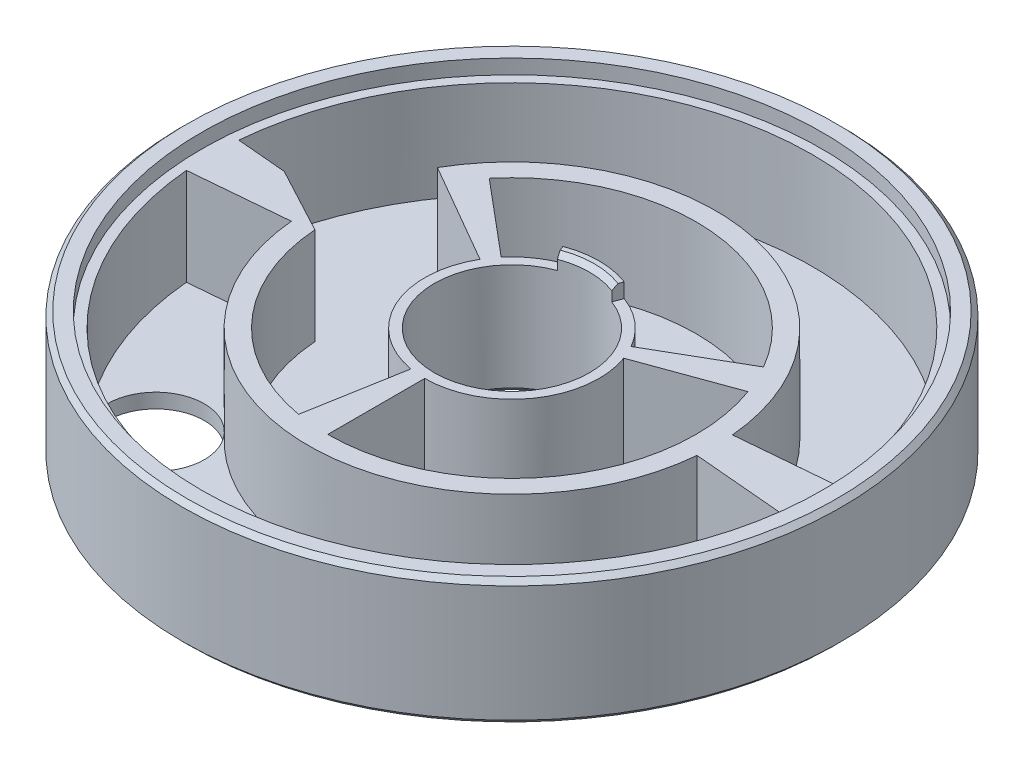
ISO-10303-21;
HEADER;
FILE_DESCRIPTION(('STEP AP214'),'2;1');
FILE_NAME('part.step','',(''),(''),'','','');
FILE_SCHEMA(('AUTOMOTIVE_DESIGN { 1 0 10303 214 1 1 1 1 }'));
ENDSEC;
DATA;
#1=APPLICATION_CONTEXT('core data for automotive mechanical design processes');
#2=APPLICATION_PROTOCOL_DEFINITION('international standard','automotive_design',2000,#1);
#3=PRODUCT_CONTEXT('',#1,'mechanical');
#4=PRODUCT('Part','Part','',(#3));
#5=PRODUCT_RELATED_PRODUCT_CATEGORY('part','',(#4));
#6=PRODUCT_DEFINITION_FORMATION('','',#4);
#7=PRODUCT_DEFINITION_CONTEXT('part definition',#1,'design');
#8=PRODUCT_DEFINITION('design','',#6,#7);
#9=PRODUCT_DEFINITION_SHAPE('','',#8);
#10=(LENGTH_UNIT() NAMED_UNIT(*) SI_UNIT(.MILLI.,.METRE.));
#11=(NAMED_UNIT(*) PLANE_ANGLE_UNIT() SI_UNIT($,.RADIAN.));
#12=(NAMED_UNIT(*) SI_UNIT($,.STERADIAN.) SOLID_ANGLE_UNIT());
#13=UNCERTAINTY_MEASURE_WITH_UNIT(LENGTH_MEASURE(1.E-05),#10,'distance_accuracy_value','');
#14=(GEOMETRIC_REPRESENTATION_CONTEXT(3) GLOBAL_UNCERTAINTY_ASSIGNED_CONTEXT((#13)) GLOBAL_UNIT_ASSIGNED_CONTEXT((#10,
#11,#12)) REPRESENTATION_CONTEXT('',''));
#15=CARTESIAN_POINT('',(0.,0.,0.));
#16=DIRECTION('',(0.,0.,1.));
#17=DIRECTION('',(1.,0.,0.));
#18=AXIS2_PLACEMENT_3D('',#15,#16,#17);
#19=CARTESIAN_POINT('',(-30.8820356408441,-11.5,2.70182802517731));
#20=DIRECTION('',(0.,-1.,0.));
#21=DIRECTION('',(0.,0.,-1.));
#22=AXIS2_PLACEMENT_3D('',#19,#20,#21);
#23=PLANE('',#22);
#24=CARTESIAN_POINT('',(-19.1097515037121,-11.5,17.6300141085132));
#25=DIRECTION('',(0.,1.,0.));
#26=DIRECTION('',(0.,0.,1.));
#27=AXIS2_PLACEMENT_3D('',#24,#25,#26);
#28=CIRCLE('',#27,5.);
#29=CARTESIAN_POINT('',(-15.4347992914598,-11.5,14.2396267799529));
#30=VERTEX_POINT('',#29);
#31=CARTESIAN_POINT('',(-22.7847037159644,-11.5,21.0204014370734));
#32=VERTEX_POINT('',#31);
#33=EDGE_CURVE('E47',#30,#32,#28,.T.);
#34=ORIENTED_EDGE('',*,*,#33,.F.);
#35=CARTESIAN_POINT('',(0.,-11.5,0.));
#36=DIRECTION('',(0.,1.,0.));
#37=DIRECTION('',(0.,0.,1.));
#38=AXIS2_PLACEMENT_3D('',#35,#36,#37);
#39=CIRCLE('',#38,21.);
#40=CARTESIAN_POINT('',(-20.9200886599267,-11.5,1.83027059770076));
#41=VERTEX_POINT('',#40);
#42=EDGE_CURVE('E231',#41,#30,#39,.T.);
#43=ORIENTED_EDGE('',*,*,#42,.F.);
#44=DIRECTION('',(0.996194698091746,0.,-0.0871557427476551));
#45=VECTOR('',#44,1.);
#46=CARTESIAN_POINT('',(-30.8820356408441,-11.5,2.70182802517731));
#47=LINE('',#46,#45);
#48=CARTESIAN_POINT('',(-30.8820356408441,-11.5,2.70182802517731));
#49=VERTEX_POINT('',#48);
#50=EDGE_CURVE('E476',#49,#41,#47,.T.);
#51=ORIENTED_EDGE('',*,*,#50,.F.);
#52=CARTESIAN_POINT('',(0.,-11.5,0.));
#53=DIRECTION('',(0.,1.,0.));
#54=DIRECTION('',(0.,0.,1.));
#55=AXIS2_PLACEMENT_3D('',#52,#53,#54);
#56=CIRCLE('',#55,31.);
#57=EDGE_CURVE('E234',#49,#32,#56,.T.);
#58=ORIENTED_EDGE('',*,*,#57,.T.);
#59=EDGE_LOOP('',(#34,#43,#51,#58));
#60=FACE_BOUND('',#59,.T.);
#61=ADVANCED_FACE('F33',(#60),#23,.F.);
#62=EDGE_CURVE('E221',#32,#30,#28,.T.);
#63=ORIENTED_EDGE('',*,*,#62,.F.);
#64=CARTESIAN_POINT('',(30.8820356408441,-11.5,2.70182802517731));
#65=VERTEX_POINT('',#64);
#66=EDGE_CURVE('E249',#32,#65,#56,.T.);
#67=ORIENTED_EDGE('',*,*,#66,.T.);
#68=DIRECTION('',(-0.996194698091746,0.,-0.087155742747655));
#69=VECTOR('',#68,1.);
#70=CARTESIAN_POINT('',(30.8820356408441,-11.5,2.70182802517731));
#71=LINE('',#70,#69);
#72=CARTESIAN_POINT('',(20.9200886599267,-11.5,1.83027059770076));
#73=VERTEX_POINT('',#72);
#74=EDGE_CURVE('E240',#65,#73,#71,.T.);
#75=ORIENTED_EDGE('',*,*,#74,.T.);
#76=EDGE_CURVE('E237',#30,#73,#39,.T.);
#77=ORIENTED_EDGE('',*,*,#76,.F.);
#78=EDGE_LOOP('',(#63,#67,#75,#77));
#79=FACE_BOUND('',#78,.T.);
#80=ADVANCED_FACE('F238',(#79),#23,.F.);
#81=CARTESIAN_POINT('',(17.8541597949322,-11.5,-6.49838272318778));
#82=DIRECTION('',(0.,1.,0.));
#83=DIRECTION('',(0.,0.,1.));
#84=AXIS2_PLACEMENT_3D('',#81,#82,#83);
#85=PLANE('',#84);
#86=CARTESIAN_POINT('',(13.9709190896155,-11.5,0.901897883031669));
#87=DIRECTION('',(0.,1.,0.));
#88=DIRECTION('',(0.,0.,1.));
#89=AXIS2_PLACEMENT_3D('',#86,#87,#88);
#90=CIRCLE('',#89,5.);
#91=CARTESIAN_POINT('',(18.9605330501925,-11.5,1.22400426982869));
#92=VERTEX_POINT('',#91);
#93=CARTESIAN_POINT('',(8.98130512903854,-11.5,0.579791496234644));
#94=VERTEX_POINT('',#93);
#95=EDGE_CURVE('E54',#92,#94,#90,.T.);
#96=ORIENTED_EDGE('',*,*,#95,.F.);
#97=CARTESIAN_POINT('',(0.,-11.5,0.));
#98=DIRECTION('',(0.,-1.,0.));
#99=DIRECTION('',(0.,0.,-1.));
#100=AXIS2_PLACEMENT_3D('',#97,#98,#99);
#101=CIRCLE('',#100,19.);
#102=CARTESIAN_POINT('',(17.8541597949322,-11.5,-6.49838272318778));
#103=VERTEX_POINT('',#102);
#104=EDGE_CURVE('E317',#103,#92,#101,.T.);
#105=ORIENTED_EDGE('',*,*,#104,.F.);
#106=DIRECTION('',(-0.939692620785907,0.,0.342020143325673));
#107=VECTOR('',#106,1.);
#108=CARTESIAN_POINT('',(17.8541597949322,-11.5,-6.49838272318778));
#109=LINE('',#108,#107);
#110=CARTESIAN_POINT('',(8.45723358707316,-11.5,-3.07818128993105));
#111=VERTEX_POINT('',#110);
#112=EDGE_CURVE('E306',#103,#111,#109,.T.);
#113=ORIENTED_EDGE('',*,*,#112,.T.);
#114=CARTESIAN_POINT('',(0.,-11.5,0.));
#115=DIRECTION('',(0.,-1.,0.));
#116=DIRECTION('',(0.,0.,-1.));
#117=AXIS2_PLACEMENT_3D('',#114,#115,#116);
#118=CIRCLE('',#117,9.);
#119=EDGE_CURVE('E313',#111,#94,#118,.T.);
#120=ORIENTED_EDGE('',*,*,#119,.T.);
#121=EDGE_LOOP('',(#96,#105,#113,#120));
#122=FACE_BOUND('',#121,.T.);
#123=ADVANCED_FACE('F506',(#122),#85,.T.);
#124=CARTESIAN_POINT('',(-3.29931537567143,-11.5,18.711347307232));
#125=DIRECTION('',(0.,1.,0.));
#126=DIRECTION('',(-0.866025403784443,0.,-0.499999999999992));
#127=AXIS2_PLACEMENT_3D('',#124,#125,#126);
#128=PLANE('',#127);
#129=CARTESIAN_POINT('',(24.9533913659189,-11.5,-7.30262003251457));
#130=DIRECTION('',(0.,1.,0.));
#131=DIRECTION('',(0.,0.,1.));
#132=AXIS2_PLACEMENT_3D('',#129,#130,#131);
#133=CIRCLE('',#132,5.);
#134=CARTESIAN_POINT('',(29.7521204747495,-11.5,-8.70697003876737));
#135=VERTEX_POINT('',#134);
#136=CARTESIAN_POINT('',(20.1546622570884,-11.5,-5.89827002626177));
#137=VERTEX_POINT('',#136);
#138=EDGE_CURVE('E907',#135,#137,#133,.T.);
#139=ORIENTED_EDGE('',*,*,#138,.F.);
#140=CARTESIAN_POINT('',(0.,-11.5,0.));
#141=DIRECTION('',(0.,1.,0.));
#142=DIRECTION('',(0.,0.,-1.));
#143=AXIS2_PLACEMENT_3D('',#140,#141,#142);
#144=CIRCLE('',#143,31.);
#145=CARTESIAN_POINT('',(-30.8820356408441,-11.5,-2.70182802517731));
#146=VERTEX_POINT('',#145);
#147=EDGE_CURVE('E446',#135,#146,#144,.T.);
#148=ORIENTED_EDGE('',*,*,#147,.T.);
#149=DIRECTION('',(0.996194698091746,0.,0.087155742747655));
#150=VECTOR('',#149,1.);
#151=CARTESIAN_POINT('',(-30.8820356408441,-11.5,-2.70182802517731));
#152=LINE('',#151,#150);
#153=CARTESIAN_POINT('',(-25.7458783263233,-11.5,-2.25247248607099));
#154=VERTEX_POINT('',#153);
#155=EDGE_CURVE('E435',#146,#154,#152,.T.);
#156=ORIENTED_EDGE('',*,*,#155,.T.);
#157=DIRECTION('',(-0.882044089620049,0.,-0.471166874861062));
#158=VECTOR('',#157,1.);
#159=CARTESIAN_POINT('',(-17.837276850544,-11.5,1.97211343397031));
#160=LINE('',#159,#158);
#161=CARTESIAN_POINT('',(-18.9499829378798,-11.5,1.37773243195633));
#162=VERTEX_POINT('',#161);
#163=EDGE_CURVE('E444',#162,#154,#160,.T.);
#164=ORIENTED_EDGE('',*,*,#163,.F.);
#165=CARTESIAN_POINT('',(0.,-11.5,0.));
#166=DIRECTION('',(0.,-1.,0.));
#167=DIRECTION('',(0.866025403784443,0.,0.499999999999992));
#168=AXIS2_PLACEMENT_3D('',#165,#166,#167);
#169=CIRCLE('',#168,19.);
#170=CARTESIAN_POINT('',(-3.29931537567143,-11.5,18.711347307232));
#171=VERTEX_POINT('',#170);
#172=EDGE_CURVE('E269',#171,#162,#169,.T.);
#173=ORIENTED_EDGE('',*,*,#172,.F.);
#174=DIRECTION('',(0.173648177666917,0.,-0.98480775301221));
#175=VECTOR('',#174,1.);
#176=CARTESIAN_POINT('',(-3.29931537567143,-11.5,18.711347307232));
#177=LINE('',#176,#175);
#178=CARTESIAN_POINT('',(-1.56283359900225,-11.5,8.86326977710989));
#179=VERTEX_POINT('',#178);
#180=EDGE_CURVE('E261',#171,#179,#177,.T.);
#181=ORIENTED_EDGE('',*,*,#180,.T.);
#182=CARTESIAN_POINT('',(0.,-11.5,0.));
#183=DIRECTION('',(0.,-1.,0.));
#184=DIRECTION('',(0.866025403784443,0.,0.499999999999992));
#185=AXIS2_PLACEMENT_3D('',#182,#183,#184);
#186=CIRCLE('',#185,9.);
#187=CARTESIAN_POINT('',(-7.79422863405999,-11.5,-4.49999999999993));
#188=VERTEX_POINT('',#187);
#189=EDGE_CURVE('E267',#179,#188,#186,.T.);
#190=ORIENTED_EDGE('',*,*,#189,.T.);
#191=DIRECTION('',(0.866025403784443,0.,0.499999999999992));
#192=VECTOR('',#191,1.);
#193=CARTESIAN_POINT('',(-16.4544826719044,-11.5,-9.49999999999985));
#194=LINE('',#193,#192);
#195=CARTESIAN_POINT('',(-18.1865334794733,-11.5,-10.5));
#196=VERTEX_POINT('',#195);
#197=EDGE_CURVE('E254',#196,#188,#194,.T.);
#198=ORIENTED_EDGE('',*,*,#197,.F.);
#199=CARTESIAN_POINT('',(0.,-11.5,0.));
#200=DIRECTION('',(0.,1.,0.));
#201=DIRECTION('',(0.,0.,-1.));
#202=AXIS2_PLACEMENT_3D('',#199,#200,#201);
#203=CIRCLE('',#202,21.);
#204=EDGE_CURVE('E462',#137,#196,#203,.T.);
#205=ORIENTED_EDGE('',*,*,#204,.F.);
#206=EDGE_LOOP('',(#139,#148,#156,#164,#173,#181,#190,#198,#205));
#207=FACE_BOUND('',#206,.T.);
#208=ADVANCED_FACE('F442',(#207),#128,.T.);
#209=CARTESIAN_POINT('',(0.,-1.5,0.));
#210=DIRECTION('',(0.,1.,0.));
#211=DIRECTION('',(0.,0.,1.));
#212=AXIS2_PLACEMENT_3D('',#209,#210,#211);
#213=PLANE('',#212);
#214=DIRECTION('',(0.882044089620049,0.,0.471166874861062));
#215=VECTOR('',#214,1.);
#216=CARTESIAN_POINT('',(-4.77943431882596,-1.5,8.94730087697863));
#217=LINE('',#216,#215);
#218=CARTESIAN_POINT('',(-25.7458783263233,-1.5,-2.252472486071));
#219=VERTEX_POINT('',#218);
#220=CARTESIAN_POINT('',(-18.9499829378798,-1.5,1.37773243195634));
#221=VERTEX_POINT('',#220);
#222=EDGE_CURVE('E911',#219,#221,#217,.T.);
#223=ORIENTED_EDGE('',*,*,#222,.F.);
#224=DIRECTION('',(0.996194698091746,0.,0.087155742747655));
#225=VECTOR('',#224,1.);
#226=CARTESIAN_POINT('',(0.,-1.5,0.));
#227=LINE('',#226,#225);
#228=CARTESIAN_POINT('',(-30.8820356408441,-1.5,-2.70182802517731));
#229=VERTEX_POINT('',#228);
#230=EDGE_CURVE('E420',#229,#219,#227,.T.);
#231=ORIENTED_EDGE('',*,*,#230,.F.);
#232=CARTESIAN_POINT('',(0.,-1.5,0.));
#233=DIRECTION('',(0.,1.,0.));
#234=DIRECTION('',(0.,0.,1.));
#235=AXIS2_PLACEMENT_3D('',#232,#233,#234);
#236=CIRCLE('',#235,31.);
#237=CARTESIAN_POINT('',(30.8820356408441,-1.5,-2.70182802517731));
#238=VERTEX_POINT('',#237);
#239=EDGE_CURVE('E425',#238,#229,#236,.T.);
#240=ORIENTED_EDGE('',*,*,#239,.F.);
#241=DIRECTION('',(-0.996194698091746,0.,0.087155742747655));
#242=VECTOR('',#241,1.);
#243=CARTESIAN_POINT('',(0.,-1.5,0.));
#244=LINE('',#243,#242);
#245=CARTESIAN_POINT('',(20.9200886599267,-1.5,-1.83027059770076));
#246=VERTEX_POINT('',#245);
#247=EDGE_CURVE('E428',#238,#246,#244,.T.);
#248=ORIENTED_EDGE('',*,*,#247,.T.);
#249=CARTESIAN_POINT('',(0.,-1.5,0.));
#250=DIRECTION('',(0.,1.,0.));
#251=DIRECTION('',(0.,0.,1.));
#252=AXIS2_PLACEMENT_3D('',#249,#250,#251);
#253=CIRCLE('',#252,21.);
#254=CARTESIAN_POINT('',(-18.1865334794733,-1.5,-10.5));
#255=VERTEX_POINT('',#254);
#256=EDGE_CURVE('E423',#255,#246,#253,.F.);
#257=ORIENTED_EDGE('',*,*,#256,.F.);
#258=DIRECTION('',(0.866025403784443,0.,0.499999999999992));
#259=VECTOR('',#258,1.);
#260=CARTESIAN_POINT('',(0.,-1.5,0.));
#261=LINE('',#260,#259);
#262=CARTESIAN_POINT('',(-7.79422863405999,-1.5,-4.49999999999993));
#263=VERTEX_POINT('',#262);
#264=EDGE_CURVE('E399',#255,#263,#261,.T.);
#265=ORIENTED_EDGE('',*,*,#264,.T.);
#266=CARTESIAN_POINT('',(0.,-1.5,0.));
#267=DIRECTION('',(0.,1.,0.));
#268=DIRECTION('',(0.,0.,1.));
#269=AXIS2_PLACEMENT_3D('',#266,#267,#268);
#270=CIRCLE('',#269,9.);
#271=CARTESIAN_POINT('',(-1.56283359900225,-1.5,8.8632697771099));
#272=VERTEX_POINT('',#271);
#273=EDGE_CURVE('E402',#263,#272,#270,.T.);
#274=ORIENTED_EDGE('',*,*,#273,.T.);
#275=DIRECTION('',(0.173648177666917,0.,-0.984807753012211));
#276=VECTOR('',#275,1.);
#277=CARTESIAN_POINT('',(0.,-1.5,0.));
#278=LINE('',#277,#276);
#279=CARTESIAN_POINT('',(-3.29931537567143,-1.5,18.711347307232));
#280=VERTEX_POINT('',#279);
#281=EDGE_CURVE('E408',#280,#272,#278,.T.);
#282=ORIENTED_EDGE('',*,*,#281,.F.);
#283=CARTESIAN_POINT('',(0.,-1.5,0.));
#284=DIRECTION('',(0.,1.,0.));
#285=DIRECTION('',(0.,0.,1.));
#286=AXIS2_PLACEMENT_3D('',#283,#284,#285);
#287=CIRCLE('',#286,19.);
#288=EDGE_CURVE('E405',#280,#221,#287,.F.);
#289=ORIENTED_EDGE('',*,*,#288,.T.);
#290=EDGE_LOOP('',(#223,#231,#240,#248,#257,#265,#274,#282,#289));
#291=FACE_BOUND('',#290,.T.);
#292=CARTESIAN_POINT('',(0.,-1.5,0.));
#293=DIRECTION('',(0.,1.,0.));
#294=DIRECTION('',(0.,0.,1.));
#295=AXIS2_PLACEMENT_3D('',#292,#293,#294);
#296=CIRCLE('',#295,31.);
#297=CARTESIAN_POINT('',(-30.8820356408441,-1.5,2.70182802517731));
#298=VERTEX_POINT('',#297);
#299=CARTESIAN_POINT('',(30.8820356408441,-1.5,2.70182802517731));
#300=VERTEX_POINT('',#299);
#301=EDGE_CURVE('E414',#298,#300,#296,.T.);
#302=ORIENTED_EDGE('',*,*,#301,.F.);
#303=DIRECTION('',(0.996194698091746,0.,-0.087155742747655));
#304=VECTOR('',#303,1.);
#305=CARTESIAN_POINT('',(0.,-1.5,0.));
#306=LINE('',#305,#304);
#307=CARTESIAN_POINT('',(-20.9200886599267,-1.5,1.83027059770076));
#308=VERTEX_POINT('',#307);
#309=EDGE_CURVE('E417',#298,#308,#306,.T.);
#310=ORIENTED_EDGE('',*,*,#309,.T.);
#311=CARTESIAN_POINT('',(0.,-1.5,0.));
#312=DIRECTION('',(0.,1.,0.));
#313=DIRECTION('',(0.,0.,1.));
#314=AXIS2_PLACEMENT_3D('',#311,#312,#313);
#315=CIRCLE('',#314,21.);
#316=CARTESIAN_POINT('',(20.9200886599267,-1.5,1.83027059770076));
#317=VERTEX_POINT('',#316);
#318=EDGE_CURVE('E412',#317,#308,#315,.F.);
#319=ORIENTED_EDGE('',*,*,#318,.F.);
#320=DIRECTION('',(-0.996194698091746,0.,-0.087155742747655));
#321=VECTOR('',#320,1.);
#322=CARTESIAN_POINT('',(0.,-1.5,0.));
#323=LINE('',#322,#321);
#324=EDGE_CURVE('E410',#300,#317,#323,.T.);
#325=ORIENTED_EDGE('',*,*,#324,.F.);
#326=EDGE_LOOP('',(#302,#310,#319,#325));
#327=FACE_BOUND('',#326,.T.);
#328=CARTESIAN_POINT('',(0.,-1.5,0.));
#329=DIRECTION('',(0.,1.,0.));
#330=DIRECTION('',(0.,0.,1.));
#331=AXIS2_PLACEMENT_3D('',#328,#329,#330);
#332=CIRCLE('',#331,32.);
#333=CARTESIAN_POINT('',(0.,-1.5,32.));
#334=VERTEX_POINT('',#333);
#335=EDGE_CURVE('E348',#334,#334,#332,.T.);
#336=ORIENTED_EDGE('',*,*,#335,.T.);
#337=EDGE_LOOP('',(#336));
#338=FACE_BOUND('',#337,.T.);
#339=DIRECTION('',(-0.939692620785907,0.,0.342020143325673));
#340=VECTOR('',#339,1.);
#341=CARTESIAN_POINT('',(0.,-1.5,0.));
#342=LINE('',#341,#340);
#343=CARTESIAN_POINT('',(17.8541597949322,-1.5,-6.49838272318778));
#344=VERTEX_POINT('',#343);
#345=CARTESIAN_POINT('',(8.45723358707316,-1.5,-3.07818128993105));
#346=VERTEX_POINT('',#345);
#347=EDGE_CURVE('E389',#344,#346,#342,.T.);
#348=ORIENTED_EDGE('',*,*,#347,.F.);
#349=CARTESIAN_POINT('',(0.,-1.5,0.));
#350=DIRECTION('',(0.,1.,0.));
#351=DIRECTION('',(0.,0.,1.));
#352=AXIS2_PLACEMENT_3D('',#349,#350,#351);
#353=CIRCLE('',#352,19.);
#354=CARTESIAN_POINT('',(0.,-1.5,19.));
#355=VERTEX_POINT('',#354);
#356=EDGE_CURVE('E386',#344,#355,#353,.F.);
#357=ORIENTED_EDGE('',*,*,#356,.T.);
#358=DIRECTION('',(0.,0.,-1.));
#359=VECTOR('',#358,1.);
#360=CARTESIAN_POINT('',(0.,-1.5,0.));
#361=LINE('',#360,#359);
#362=CARTESIAN_POINT('',(0.,-1.5,9.));
#363=VERTEX_POINT('',#362);
#364=EDGE_CURVE('E380',#355,#363,#361,.T.);
#365=ORIENTED_EDGE('',*,*,#364,.T.);
#366=CARTESIAN_POINT('',(0.,-1.5,0.));
#367=DIRECTION('',(0.,1.,0.));
#368=DIRECTION('',(0.,0.,1.));
#369=AXIS2_PLACEMENT_3D('',#366,#367,#368);
#370=CIRCLE('',#369,9.);
#371=EDGE_CURVE('E383',#363,#346,#370,.T.);
#372=ORIENTED_EDGE('',*,*,#371,.T.);
#373=EDGE_LOOP('',(#348,#357,#365,#372));
#374=FACE_BOUND('',#373,.T.);
#375=DIRECTION('',(0.351123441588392,0.,0.936329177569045));
#376=VECTOR('',#375,1.);
#377=CARTESIAN_POINT('',(-2.80898753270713,-1.5,-7.49063342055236));
#378=LINE('',#377,#376);
#379=CARTESIAN_POINT('',(-3.16011097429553,-1.5,-8.4269625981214));
#380=VERTEX_POINT('',#379);
#381=CARTESIAN_POINT('',(-2.80898753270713,-1.5,-7.49063342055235));
#382=VERTEX_POINT('',#381);
#383=EDGE_CURVE('E321',#380,#382,#378,.T.);
#384=ORIENTED_EDGE('',*,*,#383,.F.);
#385=CARTESIAN_POINT('',(0.,-1.5,0.));
#386=DIRECTION('',(0.,1.,0.));
#387=DIRECTION('',(0.,0.,1.));
#388=AXIS2_PLACEMENT_3D('',#385,#386,#387);
#389=CIRCLE('',#388,9.);
#390=CARTESIAN_POINT('',(-6.89439998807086,-1.5,-5.7850884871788));
#391=VERTEX_POINT('',#390);
#392=EDGE_CURVE('E292',#380,#391,#389,.T.);
#393=ORIENTED_EDGE('',*,*,#392,.T.);
#394=DIRECTION('',(0.766044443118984,0.,0.642787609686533));
#395=VECTOR('',#394,1.);
#396=CARTESIAN_POINT('',(0.,-1.5,0.));
#397=LINE('',#396,#395);
#398=CARTESIAN_POINT('',(-14.5548444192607,-1.5,-12.2129645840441));
#399=VERTEX_POINT('',#398);
#400=EDGE_CURVE('E397',#399,#391,#397,.T.);
#401=ORIENTED_EDGE('',*,*,#400,.F.);
#402=CARTESIAN_POINT('',(0.,-1.5,0.));
#403=DIRECTION('',(0.,1.,0.));
#404=DIRECTION('',(0.,0.,1.));
#405=AXIS2_PLACEMENT_3D('',#402,#403,#404);
#406=CIRCLE('',#405,19.);
#407=CARTESIAN_POINT('',(16.4544826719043,-1.5,-9.50000000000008));
#408=VERTEX_POINT('',#407);
#409=EDGE_CURVE('E394',#399,#408,#406,.F.);
#410=ORIENTED_EDGE('',*,*,#409,.T.);
#411=DIRECTION('',(-0.866025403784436,0.,0.500000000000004));
#412=VECTOR('',#411,1.);
#413=CARTESIAN_POINT('',(0.,-1.5,0.));
#414=LINE('',#413,#412);
#415=CARTESIAN_POINT('',(7.79422863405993,-1.5,-4.50000000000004));
#416=VERTEX_POINT('',#415);
#417=EDGE_CURVE('E391',#408,#416,#414,.T.);
#418=ORIENTED_EDGE('',*,*,#417,.T.);
#419=CARTESIAN_POINT('',(3.16011097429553,-1.5,-8.4269625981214));
#420=VERTEX_POINT('',#419);
#421=EDGE_CURVE('E295',#416,#420,#389,.T.);
#422=ORIENTED_EDGE('',*,*,#421,.T.);
#423=DIRECTION('',(0.351123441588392,0.,-0.936329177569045));
#424=VECTOR('',#423,1.);
#425=CARTESIAN_POINT('',(2.80898753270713,-1.5,-7.49063342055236));
#426=LINE('',#425,#424);
#427=CARTESIAN_POINT('',(2.80898753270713,-1.5,-7.49063342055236));
#428=VERTEX_POINT('',#427);
#429=EDGE_CURVE('E327',#428,#420,#426,.T.);
#430=ORIENTED_EDGE('',*,*,#429,.F.);
#431=CARTESIAN_POINT('',(0.,-1.5,0.));
#432=DIRECTION('',(0.,1.,0.));
#433=DIRECTION('',(0.,0.,1.));
#434=AXIS2_PLACEMENT_3D('',#431,#432,#433);
#435=CIRCLE('',#434,8.);
#436=EDGE_CURVE('E323',#382,#428,#435,.T.);
#437=ORIENTED_EDGE('',*,*,#436,.F.);
#438=EDGE_LOOP('',(#384,#393,#401,#410,#418,#422,#430,#437));
#439=FACE_BOUND('',#438,.T.);
#440=ADVANCED_FACE('F483',(#291,#327,#338,#374,#439),#213,.T.);
#441=CARTESIAN_POINT('',(0.,0.,0.));
#442=DIRECTION('',(0.,1.,0.));
#443=DIRECTION('',(0.,0.,1.));
#444=AXIS2_PLACEMENT_3D('',#441,#442,#443);
#445=PLANE('',#444);
#446=DIRECTION('',(0.351123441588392,0.,0.936329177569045));
#447=VECTOR('',#446,1.);
#448=CARTESIAN_POINT('',(-2.80898753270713,0.,-7.49063342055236));
#449=LINE('',#448,#447);
#450=CARTESIAN_POINT('',(-3.16011097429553,0.,-8.4269625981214));
#451=VERTEX_POINT('',#450);
#452=CARTESIAN_POINT('',(-2.98454925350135,0.,-7.95879800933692));
#453=VERTEX_POINT('',#452);
#454=EDGE_CURVE('E333',#451,#453,#449,.T.);
#455=ORIENTED_EDGE('',*,*,#454,.T.);
#456=CARTESIAN_POINT('',(0.,0.,0.));
#457=DIRECTION('',(0.,1.,0.));
#458=DIRECTION('',(0.,0.,1.));
#459=AXIS2_PLACEMENT_3D('',#456,#457,#458);
#460=CIRCLE('',#459,8.50000000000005);
#461=CARTESIAN_POINT('',(2.98454925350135,0.,-7.95879800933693));
#462=VERTEX_POINT('',#461);
#463=EDGE_CURVE('E361',#453,#462,#460,.F.);
#464=ORIENTED_EDGE('',*,*,#463,.T.);
#465=DIRECTION('',(0.351123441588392,0.,-0.936329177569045));
#466=VECTOR('',#465,1.);
#467=CARTESIAN_POINT('',(2.80898753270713,0.,-7.49063342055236));
#468=LINE('',#467,#466);
#469=CARTESIAN_POINT('',(3.16011097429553,0.,-8.4269625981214));
#470=VERTEX_POINT('',#469);
#471=EDGE_CURVE('E324',#462,#470,#468,.T.);
#472=ORIENTED_EDGE('',*,*,#471,.T.);
#473=CARTESIAN_POINT('',(0.,0.,0.));
#474=DIRECTION('',(0.,1.,0.));
#475=DIRECTION('',(0.,0.,1.));
#476=AXIS2_PLACEMENT_3D('',#473,#474,#475);
#477=CIRCLE('',#476,9.);
#478=EDGE_CURVE('E320',#470,#451,#477,.T.);
#479=ORIENTED_EDGE('',*,*,#478,.T.);
#480=EDGE_LOOP('',(#455,#464,#472,#479));
#481=FACE_BOUND('',#480,.T.);
#482=ADVANCED_FACE('F583',(#481),#445,.T.);
#483=CARTESIAN_POINT('',(0.,-13.,0.));
#484=DIRECTION('',(0.,1.,0.));
#485=DIRECTION('',(0.,0.,1.));
#486=AXIS2_PLACEMENT_3D('',#483,#484,#485);
#487=CYLINDRICAL_SURFACE('',#486,8.);
#488=CARTESIAN_POINT('',(0.,-12.5000000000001,0.));
#489=DIRECTION('',(0.,1.,0.));
#490=DIRECTION('',(0.,0.,1.));
#491=AXIS2_PLACEMENT_3D('',#488,#489,#490);
#492=CIRCLE('',#491,8.);
#493=CARTESIAN_POINT('',(0.,-12.5000000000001,8.));
#494=VERTEX_POINT('',#493);
#495=EDGE_CURVE('E351',#494,#494,#492,.F.);
#496=ORIENTED_EDGE('',*,*,#495,.T.);
#497=EDGE_LOOP('',(#496));
#498=FACE_BOUND('',#497,.T.);
#499=DIRECTION('',(0.,1.,0.));
#500=VECTOR('',#499,1.);
#501=CARTESIAN_POINT('',(2.80898753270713,-1.5,-7.49063342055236));
#502=LINE('',#501,#500);
#503=CARTESIAN_POINT('',(2.80898753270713,-0.500000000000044,-7.49063342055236));
#504=VERTEX_POINT('',#503);
#505=EDGE_CURVE('E341',#428,#504,#502,.T.);
#506=ORIENTED_EDGE('',*,*,#505,.T.);
#507=CARTESIAN_POINT('',(0.,-0.500000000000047,0.));
#508=DIRECTION('',(0.,1.,0.));
#509=DIRECTION('',(0.,0.,1.));
#510=AXIS2_PLACEMENT_3D('',#507,#508,#509);
#511=CIRCLE('',#510,8.);
#512=CARTESIAN_POINT('',(-2.80898753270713,-0.500000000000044,-7.49063342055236));
#513=VERTEX_POINT('',#512);
#514=EDGE_CURVE('E356',#504,#513,#511,.T.);
#515=ORIENTED_EDGE('',*,*,#514,.T.);
#516=DIRECTION('',(0.,1.,0.));
#517=VECTOR('',#516,1.);
#518=CARTESIAN_POINT('',(-2.80898753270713,-1.5,-7.49063342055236));
#519=LINE('',#518,#517);
#520=EDGE_CURVE('E344',#382,#513,#519,.T.);
#521=ORIENTED_EDGE('',*,*,#520,.F.);
#522=ORIENTED_EDGE('',*,*,#436,.T.);
#523=EDGE_LOOP('',(#506,#515,#521,#522));
#524=FACE_BOUND('',#523,.T.);
#525=ADVANCED_FACE('F589',(#498,#524),#487,.F.);
#526=CARTESIAN_POINT('',(0.,-13.,0.));
#527=DIRECTION('',(0.,1.,0.));
#528=DIRECTION('',(0.,0.,1.));
#529=AXIS2_PLACEMENT_3D('',#526,#527,#528);
#530=CYLINDRICAL_SURFACE('',#529,34.);
#531=CARTESIAN_POINT('',(0.,-0.499999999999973,0.));
#532=DIRECTION('',(0.,1.,0.));
#533=DIRECTION('',(0.,0.,1.));
#534=AXIS2_PLACEMENT_3D('',#531,#532,#533);
#535=CIRCLE('',#534,34.);
#536=CARTESIAN_POINT('',(0.,-0.499999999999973,34.));
#537=VERTEX_POINT('',#536);
#538=EDGE_CURVE('E371',#537,#537,#535,.F.);
#539=CARTESIAN_POINT('',(0.,-12.5,0.));
#540=DIRECTION('',(0.,1.,0.));
#541=DIRECTION('',(0.,0.,1.));
#542=AXIS2_PLACEMENT_3D('',#539,#540,#541);
#543=CIRCLE('',#542,34.);
#544=CARTESIAN_POINT('',(0.,-12.5,34.));
#545=VERTEX_POINT('',#544);
#546=EDGE_CURVE('E368',#545,#545,#543,.T.);
#547=CARTESIAN_POINT('',(0.,-0.499999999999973,34.));
#548=CARTESIAN_POINT('',(0.,-0.624999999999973,34.));
#549=CARTESIAN_POINT('',(0.,-0.749999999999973,34.));
#550=CARTESIAN_POINT('',(0.,-0.999999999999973,34.));
#551=CARTESIAN_POINT('',(0.,-1.12499999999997,34.));
#552=CARTESIAN_POINT('',(0.,-1.37499999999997,34.));
#553=CARTESIAN_POINT('',(0.,-1.49999999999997,34.));
#554=CARTESIAN_POINT('',(0.,-1.74999999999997,34.));
#555=CARTESIAN_POINT('',(0.,-1.87499999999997,34.));
#556=CARTESIAN_POINT('',(0.,-2.12499999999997,34.));
#557=CARTESIAN_POINT('',(0.,-2.24999999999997,34.));
#558=CARTESIAN_POINT('',(0.,-2.49999999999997,34.));
#559=CARTESIAN_POINT('',(0.,-2.62499999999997,34.));
#560=CARTESIAN_POINT('',(0.,-2.87499999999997,34.));
#561=CARTESIAN_POINT('',(0.,-2.99999999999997,34.));
#562=CARTESIAN_POINT('',(0.,-3.24999999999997,34.));
#563=CARTESIAN_POINT('',(0.,-3.37499999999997,34.));
#564=CARTESIAN_POINT('',(0.,-3.62499999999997,34.));
#565=CARTESIAN_POINT('',(0.,-3.74999999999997,34.));
#566=CARTESIAN_POINT('',(0.,-3.99999999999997,34.));
#567=CARTESIAN_POINT('',(0.,-4.12499999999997,34.));
#568=CARTESIAN_POINT('',(0.,-4.37499999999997,34.));
#569=CARTESIAN_POINT('',(0.,-4.49999999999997,34.));
#570=CARTESIAN_POINT('',(0.,-4.74999999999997,34.));
#571=CARTESIAN_POINT('',(0.,-4.87499999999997,34.));
#572=CARTESIAN_POINT('',(0.,-5.12499999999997,34.));
#573=CARTESIAN_POINT('',(0.,-5.24999999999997,34.));
#574=CARTESIAN_POINT('',(0.,-5.49999999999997,34.));
#575=CARTESIAN_POINT('',(0.,-5.62499999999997,34.));
#576=CARTESIAN_POINT('',(0.,-5.87499999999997,34.));
#577=CARTESIAN_POINT('',(0.,-5.99999999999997,34.));
#578=CARTESIAN_POINT('',(0.,-6.24999999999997,34.));
#579=CARTESIAN_POINT('',(0.,-6.37499999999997,34.));
#580=CARTESIAN_POINT('',(0.,-6.62499999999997,34.));
#581=CARTESIAN_POINT('',(0.,-6.74999999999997,34.));
#582=CARTESIAN_POINT('',(0.,-6.99999999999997,34.));
#583=CARTESIAN_POINT('',(0.,-7.12499999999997,34.));
#584=CARTESIAN_POINT('',(0.,-7.37499999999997,34.));
#585=CARTESIAN_POINT('',(0.,-7.49999999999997,34.));
#586=CARTESIAN_POINT('',(0.,-7.74999999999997,34.));
#587=CARTESIAN_POINT('',(0.,-7.87499999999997,34.));
#588=CARTESIAN_POINT('',(0.,-8.12499999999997,34.));
#589=CARTESIAN_POINT('',(0.,-8.24999999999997,34.));
#590=CARTESIAN_POINT('',(0.,-8.49999999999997,34.));
#591=CARTESIAN_POINT('',(0.,-8.62499999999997,34.));
#592=CARTESIAN_POINT('',(0.,-8.87499999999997,34.));
#593=CARTESIAN_POINT('',(0.,-8.99999999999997,34.));
#594=CARTESIAN_POINT('',(0.,-9.24999999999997,34.));
#595=CARTESIAN_POINT('',(0.,-9.37499999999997,34.));
#596=CARTESIAN_POINT('',(0.,-9.62499999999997,34.));
#597=CARTESIAN_POINT('',(0.,-9.74999999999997,34.));
#598=CARTESIAN_POINT('',(0.,-9.99999999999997,34.));
#599=CARTESIAN_POINT('',(0.,-10.125,34.));
#600=CARTESIAN_POINT('',(0.,-10.375,34.));
#601=CARTESIAN_POINT('',(0.,-10.5,34.));
#602=CARTESIAN_POINT('',(0.,-10.75,34.));
#603=CARTESIAN_POINT('',(0.,-10.875,34.));
#604=CARTESIAN_POINT('',(0.,-11.125,34.));
#605=CARTESIAN_POINT('',(0.,-11.25,34.));
#606=CARTESIAN_POINT('',(0.,-11.5,34.));
#607=CARTESIAN_POINT('',(0.,-11.625,34.));
#608=CARTESIAN_POINT('',(0.,-11.875,34.));
#609=CARTESIAN_POINT('',(0.,-12.,34.));
#610=CARTESIAN_POINT('',(0.,-12.25,34.));
#611=CARTESIAN_POINT('',(0.,-12.375,34.));
#612=CARTESIAN_POINT('',(0.,-12.5,34.));
#613=B_SPLINE_CURVE_WITH_KNOTS('',3,(#547,#548,#549,#550,#551,#552,#553,#554,#555,#556,#557,
#558,#559,#560,#561,#562,#563,#564,#565,#566,#567,#568,#569,#570,#571,#572,#573,#574,#575,#576,
#577,#578,#579,#580,#581,#582,#583,#584,#585,#586,#587,#588,#589,#590,#591,#592,#593,#594,#595,
#596,#597,#598,#599,#600,#601,#602,#603,#604,#605,#606,#607,#608,#609,#610,#611,#612),
.UNSPECIFIED.,.F.,.F.,(4,2,2,2,2,2,2,2,2,2,2,2,2,2,2,2,2,2,2,2,2,2,2,2,2,2,2,2,2,2,2,2,4),(0.,
0.375,0.750000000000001,1.125,1.5,1.875,2.25,2.625,3.,3.375,3.75,4.125,4.5,4.875,5.25,5.625,6.,
6.375,6.75,7.125,7.5,7.875,8.25,8.625,9.,9.375,9.75,10.125,10.5,10.875,11.25,11.625,12.),.UNSPECIFIED.);
#614=EDGE_CURVE('BSEAM592',#537,#545,#613,.T.);
#615=ORIENTED_EDGE('',*,*,#538,.T.);
#616=ORIENTED_EDGE('',*,*,#546,.T.);
#617=ORIENTED_EDGE('',*,*,#614,.T.);
#618=ORIENTED_EDGE('',*,*,#614,.F.);
#619=EDGE_LOOP('',(#615,#617,#616,#618));
#620=FACE_BOUND('',#619,.T.);
#621=ADVANCED_FACE('F592',(#620),#530,.T.);
#622=CARTESIAN_POINT('',(0.,-13.,0.));
#623=DIRECTION('',(0.,1.,0.));
#624=DIRECTION('',(0.,0.,1.));
#625=AXIS2_PLACEMENT_3D('',#622,#623,#624);
#626=PLANE('',#625);
#627=CARTESIAN_POINT('',(-19.1097515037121,-13.,17.6300141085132));
#628=DIRECTION('',(0.,1.,0.));
#629=DIRECTION('',(0.,0.,1.));
#630=AXIS2_PLACEMENT_3D('',#627,#628,#629);
#631=CIRCLE('',#630,5.);
#632=CARTESIAN_POINT('',(-19.1097515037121,-13.,22.6300141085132));
#633=VERTEX_POINT('',#632);
#634=EDGE_CURVE('E235',#633,#633,#631,.T.);
#635=ORIENTED_EDGE('',*,*,#634,.T.);
#636=EDGE_LOOP('',(#635));
#637=FACE_BOUND('',#636,.T.);
#638=CARTESIAN_POINT('',(13.9709190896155,-13.,0.901897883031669));
#639=DIRECTION('',(0.,1.,0.));
#640=DIRECTION('',(0.,0.,1.));
#641=AXIS2_PLACEMENT_3D('',#638,#639,#640);
#642=CIRCLE('',#641,5.);
#643=CARTESIAN_POINT('',(13.9709190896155,-13.,5.90189788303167));
#644=VERTEX_POINT('',#643);
#645=EDGE_CURVE('E888',#644,#644,#642,.T.);
#646=ORIENTED_EDGE('',*,*,#645,.T.);
#647=EDGE_LOOP('',(#646));
#648=FACE_BOUND('',#647,.T.);
#649=CARTESIAN_POINT('',(24.9533913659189,-13.,-7.30262003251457));
#650=DIRECTION('',(0.,1.,0.));
#651=DIRECTION('',(0.,0.,1.));
#652=AXIS2_PLACEMENT_3D('',#649,#650,#651);
#653=CIRCLE('',#652,5.);
#654=CARTESIAN_POINT('',(24.9533913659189,-13.,-2.30262003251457));
#655=VERTEX_POINT('',#654);
#656=EDGE_CURVE('E904',#655,#655,#653,.T.);
#657=ORIENTED_EDGE('',*,*,#656,.T.);
#658=EDGE_LOOP('',(#657));
#659=FACE_BOUND('',#658,.T.);
#660=CARTESIAN_POINT('',(0.,-13.,0.));
#661=DIRECTION('',(0.,1.,0.));
#662=DIRECTION('',(0.,0.,1.));
#663=AXIS2_PLACEMENT_3D('',#660,#661,#662);
#664=CIRCLE('',#663,33.5);
#665=CARTESIAN_POINT('',(0.,-13.,33.5));
#666=VERTEX_POINT('',#665);
#667=EDGE_CURVE('E377',#666,#666,#664,.F.);
#668=ORIENTED_EDGE('',*,*,#667,.T.);
#669=EDGE_LOOP('',(#668));
#670=FACE_BOUND('',#669,.T.);
#671=CARTESIAN_POINT('',(0.,-13.,0.));
#672=DIRECTION('',(0.,1.,0.));
#673=DIRECTION('',(0.,0.,1.));
#674=AXIS2_PLACEMENT_3D('',#671,#672,#673);
#675=CIRCLE('',#674,8.49999999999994);
#676=CARTESIAN_POINT('',(0.,-13.,8.49999999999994));
#677=VERTEX_POINT('',#676);
#678=EDGE_CURVE('E374',#677,#677,#675,.T.);
#679=ORIENTED_EDGE('',*,*,#678,.T.);
#680=EDGE_LOOP('',(#679));
#681=FACE_BOUND('',#680,.T.);
#682=ADVANCED_FACE('F594',(#637,#648,#659,#670,#681),#626,.F.);
#683=CARTESIAN_POINT('',(0.,0.,0.));
#684=DIRECTION('',(0.,1.,0.));
#685=DIRECTION('',(0.,0.,1.));
#686=AXIS2_PLACEMENT_3D('',#683,#684,#685);
#687=CIRCLE('',#686,33.5);
#688=CARTESIAN_POINT('',(0.,0.,33.5));
#689=VERTEX_POINT('',#688);
#690=EDGE_CURVE('E365',#689,#689,#687,.T.);
#691=ORIENTED_EDGE('',*,*,#690,.T.);
#692=EDGE_LOOP('',(#691));
#693=FACE_BOUND('',#692,.T.);
#694=CARTESIAN_POINT('',(0.,0.,0.));
#695=DIRECTION('',(0.,1.,0.));
#696=DIRECTION('',(0.,0.,1.));
#697=AXIS2_PLACEMENT_3D('',#694,#695,#696);
#698=CIRCLE('',#697,32.);
#699=CARTESIAN_POINT('',(0.,0.,32.));
#700=VERTEX_POINT('',#699);
#701=EDGE_CURVE('E340',#700,#700,#698,.T.);
#702=ORIENTED_EDGE('',*,*,#701,.F.);
#703=EDGE_LOOP('',(#702));
#704=FACE_BOUND('',#703,.T.);
#705=ADVANCED_FACE('F587',(#693,#704),#445,.T.);
#706=CARTESIAN_POINT('',(0.,-1.5,0.));
#707=DIRECTION('',(0.,1.,0.));
#708=DIRECTION('',(0.,0.,1.));
#709=AXIS2_PLACEMENT_3D('',#706,#707,#708);
#710=CYLINDRICAL_SURFACE('',#709,32.);
#711=ORIENTED_EDGE('',*,*,#335,.F.);
#712=EDGE_LOOP('',(#711));
#713=FACE_BOUND('',#712,.T.);
#714=ORIENTED_EDGE('',*,*,#701,.T.);
#715=EDGE_LOOP('',(#714));
#716=FACE_BOUND('',#715,.T.);
#717=ADVANCED_FACE('F579',(#713,#716),#710,.F.);
#718=CARTESIAN_POINT('',(0.,-1.5,0.));
#719=DIRECTION('',(0.,1.,0.));
#720=DIRECTION('',(0.,0.,1.));
#721=AXIS2_PLACEMENT_3D('',#718,#719,#720);
#722=CYLINDRICAL_SURFACE('',#721,9.);
#723=ORIENTED_EDGE('',*,*,#478,.F.);
#724=DIRECTION('',(0.,1.,0.));
#725=VECTOR('',#724,1.);
#726=CARTESIAN_POINT('',(3.16011097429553,-1.5,-8.4269625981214));
#727=LINE('',#726,#725);
#728=EDGE_CURVE('E337',#420,#470,#727,.T.);
#729=ORIENTED_EDGE('',*,*,#728,.F.);
#730=ORIENTED_EDGE('',*,*,#421,.F.);
#731=DIRECTION('',(0.,1.,0.));
#732=VECTOR('',#731,1.);
#733=CARTESIAN_POINT('',(7.79422863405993,-11.5,-4.50000000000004));
#734=LINE('',#733,#732);
#735=CARTESIAN_POINT('',(7.79422863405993,-11.5,-4.50000000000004));
#736=VERTEX_POINT('',#735);
#737=EDGE_CURVE('E277',#736,#416,#734,.T.);
#738=ORIENTED_EDGE('',*,*,#737,.F.);
#739=CARTESIAN_POINT('',(0.,-11.5,0.));
#740=DIRECTION('',(0.,-1.,0.));
#741=DIRECTION('',(-0.866025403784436,0.,0.500000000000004));
#742=AXIS2_PLACEMENT_3D('',#739,#740,#741);
#743=CIRCLE('',#742,9.);
#744=CARTESIAN_POINT('',(-6.89439998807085,-11.5,-5.78508848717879));
#745=VERTEX_POINT('',#744);
#746=EDGE_CURVE('E287',#745,#736,#743,.T.);
#747=ORIENTED_EDGE('',*,*,#746,.F.);
#748=DIRECTION('',(0.,1.,0.));
#749=VECTOR('',#748,1.);
#750=CARTESIAN_POINT('',(-6.89439998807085,-11.5,-5.78508848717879));
#751=LINE('',#750,#749);
#752=EDGE_CURVE('E284',#745,#391,#751,.T.);
#753=ORIENTED_EDGE('',*,*,#752,.T.);
#754=ORIENTED_EDGE('',*,*,#392,.F.);
#755=DIRECTION('',(0.,1.,0.));
#756=VECTOR('',#755,1.);
#757=CARTESIAN_POINT('',(-3.16011097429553,-1.5,-8.4269625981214));
#758=LINE('',#757,#756);
#759=EDGE_CURVE('E330',#380,#451,#758,.T.);
#760=ORIENTED_EDGE('',*,*,#759,.T.);
#761=EDGE_LOOP('',(#723,#729,#730,#738,#747,#753,#754,#760));
#762=FACE_BOUND('',#761,.T.);
#763=ADVANCED_FACE('F571',(#762),#722,.T.);
#764=CARTESIAN_POINT('',(2.80898753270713,-1.5,-7.49063342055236));
#765=DIRECTION('',(0.936329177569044,0.,0.351123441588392));
#766=DIRECTION('',(0.351123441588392,0.,-0.936329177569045));
#767=AXIS2_PLACEMENT_3D('',#764,#765,#766);
#768=PLANE('',#767);
#769=ORIENTED_EDGE('',*,*,#471,.F.);
#770=DIRECTION('',(0.24828176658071,0.707106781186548,-0.662084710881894));
#771=VECTOR('',#770,1.);
#772=CARTESIAN_POINT('',(0.,-8.50000000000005,0.));
#773=LINE('',#772,#771);
#774=EDGE_CURVE('E363',#462,#504,#773,.F.);
#775=ORIENTED_EDGE('',*,*,#774,.T.);
#776=ORIENTED_EDGE('',*,*,#505,.F.);
#777=ORIENTED_EDGE('',*,*,#429,.T.);
#778=ORIENTED_EDGE('',*,*,#728,.T.);
#779=EDGE_LOOP('',(#769,#775,#776,#777,#778));
#780=FACE_BOUND('',#779,.T.);
#781=ADVANCED_FACE('F567',(#780),#768,.T.);
#782=CARTESIAN_POINT('',(-2.80898753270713,-1.5,-7.49063342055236));
#783=DIRECTION('',(-0.936329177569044,0.,0.351123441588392));
#784=DIRECTION('',(0.351123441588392,0.,0.936329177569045));
#785=AXIS2_PLACEMENT_3D('',#782,#783,#784);
#786=PLANE('',#785);
#787=ORIENTED_EDGE('',*,*,#520,.T.);
#788=DIRECTION('',(0.24828176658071,-0.707106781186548,0.662084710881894));
#789=VECTOR('',#788,1.);
#790=CARTESIAN_POINT('',(0.,-8.50000000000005,0.));
#791=LINE('',#790,#789);
#792=EDGE_CURVE('E359',#513,#453,#791,.F.);
#793=ORIENTED_EDGE('',*,*,#792,.T.);
#794=ORIENTED_EDGE('',*,*,#454,.F.);
#795=ORIENTED_EDGE('',*,*,#759,.F.);
#796=ORIENTED_EDGE('',*,*,#383,.T.);
#797=EDGE_LOOP('',(#787,#793,#794,#795,#796));
#798=FACE_BOUND('',#797,.T.);
#799=ADVANCED_FACE('F570',(#798),#786,.T.);
#800=CARTESIAN_POINT('',(0.,-0.500000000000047,0.));
#801=DIRECTION('',(0.,1.,0.));
#802=DIRECTION('',(0.,0.,1.));
#803=AXIS2_PLACEMENT_3D('',#800,#801,#802);
#804=CONICAL_SURFACE('',#803,8.,0.785398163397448);
#805=ORIENTED_EDGE('',*,*,#774,.F.);
#806=ORIENTED_EDGE('',*,*,#463,.F.);
#807=ORIENTED_EDGE('',*,*,#792,.F.);
#808=ORIENTED_EDGE('',*,*,#514,.F.);
#809=EDGE_LOOP('',(#805,#806,#807,#808));
#810=FACE_BOUND('',#809,.T.);
#811=ADVANCED_FACE('F575',(#810),#804,.F.);
#812=CARTESIAN_POINT('',(0.,0.,0.));
#813=DIRECTION('',(0.,-1.,0.));
#814=DIRECTION('',(0.,0.,-1.));
#815=AXIS2_PLACEMENT_3D('',#812,#813,#814);
#816=CONICAL_SURFACE('',#815,33.5,0.785398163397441);
#817=ORIENTED_EDGE('',*,*,#538,.F.);
#818=EDGE_LOOP('',(#817));
#819=FACE_BOUND('',#818,.T.);
#820=ORIENTED_EDGE('',*,*,#690,.F.);
#821=EDGE_LOOP('',(#820));
#822=FACE_BOUND('',#821,.T.);
#823=ADVANCED_FACE('F606',(#819,#822),#816,.T.);
#824=CARTESIAN_POINT('',(0.,-12.5,0.));
#825=DIRECTION('',(0.,1.,0.));
#826=DIRECTION('',(0.,0.,1.));
#827=AXIS2_PLACEMENT_3D('',#824,#825,#826);
#828=CONICAL_SURFACE('',#827,34.,0.785398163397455);
#829=ORIENTED_EDGE('',*,*,#667,.F.);
#830=EDGE_LOOP('',(#829));
#831=FACE_BOUND('',#830,.T.);
#832=ORIENTED_EDGE('',*,*,#546,.F.);
#833=EDGE_LOOP('',(#832));
#834=FACE_BOUND('',#833,.T.);
#835=ADVANCED_FACE('F609',(#831,#834),#828,.T.);
#836=CARTESIAN_POINT('',(0.,-13.,0.));
#837=DIRECTION('',(0.,-1.,0.));
#838=DIRECTION('',(0.,0.,-1.));
#839=AXIS2_PLACEMENT_3D('',#836,#837,#838);
#840=CONICAL_SURFACE('',#839,8.49999999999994,0.785398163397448);
#841=ORIENTED_EDGE('',*,*,#495,.F.);
#842=EDGE_LOOP('',(#841));
#843=FACE_BOUND('',#842,.T.);
#844=ORIENTED_EDGE('',*,*,#678,.F.);
#845=EDGE_LOOP('',(#844));
#846=FACE_BOUND('',#845,.T.);
#847=ADVANCED_FACE('F35',(#843,#846),#840,.F.);
#848=CARTESIAN_POINT('',(0.,-12.5000000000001,0.));
#849=DIRECTION('',(0.,-1.,0.));
#850=DIRECTION('',(0.,0.,-1.));
#851=AXIS2_PLACEMENT_3D('',#848,#849,#850);
#852=CYLINDRICAL_SURFACE('',#851,19.);
#853=DIRECTION('',(0.,-1.,0.));
#854=VECTOR('',#853,1.);
#855=CARTESIAN_POINT('',(17.8541597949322,0.,-6.49838272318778));
#856=LINE('',#855,#854);
#857=EDGE_CURVE('E304',#344,#103,#856,.T.);
#858=ORIENTED_EDGE('',*,*,#857,.T.);
#859=ORIENTED_EDGE('',*,*,#104,.T.);
#860=CARTESIAN_POINT('',(0.,-11.5,19.));
#861=VERTEX_POINT('',#860);
#862=EDGE_CURVE('E316',#92,#861,#101,.T.);
#863=ORIENTED_EDGE('',*,*,#862,.T.);
#864=DIRECTION('',(0.,-1.,0.));
#865=VECTOR('',#864,1.);
#866=CARTESIAN_POINT('',(0.,0.,19.));
#867=LINE('',#866,#865);
#868=EDGE_CURVE('E296',#355,#861,#867,.T.);
#869=ORIENTED_EDGE('',*,*,#868,.F.);
#870=ORIENTED_EDGE('',*,*,#356,.F.);
#871=EDGE_LOOP('',(#858,#859,#863,#869,#870));
#872=FACE_BOUND('',#871,.T.);
#873=ADVANCED_FACE('F562',(#872),#852,.F.);
#874=EDGE_CURVE('E889',#94,#92,#90,.T.);
#875=ORIENTED_EDGE('',*,*,#874,.F.);
#876=CARTESIAN_POINT('',(0.,-11.5,9.));
#877=VERTEX_POINT('',#876);
#878=EDGE_CURVE('E312',#94,#877,#118,.T.);
#879=ORIENTED_EDGE('',*,*,#878,.T.);
#880=DIRECTION('',(0.,0.,-1.));
#881=VECTOR('',#880,1.);
#882=CARTESIAN_POINT('',(0.,-11.5,19.));
#883=LINE('',#882,#881);
#884=EDGE_CURVE('E299',#861,#877,#883,.T.);
#885=ORIENTED_EDGE('',*,*,#884,.F.);
#886=ORIENTED_EDGE('',*,*,#862,.F.);
#887=EDGE_LOOP('',(#875,#879,#885,#886));
#888=FACE_BOUND('',#887,.T.);
#889=ADVANCED_FACE('F558',(#888),#85,.T.);
#890=CARTESIAN_POINT('',(0.,-12.5000000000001,0.));
#891=DIRECTION('',(0.,-1.,0.));
#892=DIRECTION('',(0.,0.,-1.));
#893=AXIS2_PLACEMENT_3D('',#890,#891,#892);
#894=CYLINDRICAL_SURFACE('',#893,9.);
#895=DIRECTION('',(0.,1.,0.));
#896=VECTOR('',#895,1.);
#897=CARTESIAN_POINT('',(0.,-11.5,9.));
#898=LINE('',#897,#896);
#899=EDGE_CURVE('E302',#877,#363,#898,.T.);
#900=ORIENTED_EDGE('',*,*,#899,.F.);
#901=ORIENTED_EDGE('',*,*,#878,.F.);
#902=ORIENTED_EDGE('',*,*,#119,.F.);
#903=DIRECTION('',(0.,1.,0.));
#904=VECTOR('',#903,1.);
#905=CARTESIAN_POINT('',(8.45723358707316,-11.5,-3.07818128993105));
#906=LINE('',#905,#904);
#907=EDGE_CURVE('E309',#111,#346,#906,.T.);
#908=ORIENTED_EDGE('',*,*,#907,.T.);
#909=ORIENTED_EDGE('',*,*,#371,.F.);
#910=EDGE_LOOP('',(#900,#901,#902,#908,#909));
#911=FACE_BOUND('',#910,.T.);
#912=ADVANCED_FACE('F554',(#911),#894,.T.);
#913=CARTESIAN_POINT('',(0.,0.,0.));
#914=DIRECTION('',(-0.342020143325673,0.,-0.939692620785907));
#915=DIRECTION('',(-0.939692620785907,0.,0.342020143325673));
#916=AXIS2_PLACEMENT_3D('',#913,#914,#915);
#917=PLANE('',#916);
#918=ORIENTED_EDGE('',*,*,#347,.T.);
#919=ORIENTED_EDGE('',*,*,#907,.F.);
#920=ORIENTED_EDGE('',*,*,#112,.F.);
#921=ORIENTED_EDGE('',*,*,#857,.F.);
#922=EDGE_LOOP('',(#918,#919,#920,#921));
#923=FACE_BOUND('',#922,.T.);
#924=ADVANCED_FACE('F550',(#923),#917,.F.);
#925=CARTESIAN_POINT('',(0.,0.,0.));
#926=DIRECTION('',(1.,0.,0.));
#927=DIRECTION('',(0.,0.,-1.));
#928=AXIS2_PLACEMENT_3D('',#925,#926,#927);
#929=PLANE('',#928);
#930=ORIENTED_EDGE('',*,*,#868,.T.);
#931=ORIENTED_EDGE('',*,*,#884,.T.);
#932=ORIENTED_EDGE('',*,*,#899,.T.);
#933=ORIENTED_EDGE('',*,*,#364,.F.);
#934=EDGE_LOOP('',(#930,#931,#932,#933));
#935=FACE_BOUND('',#934,.T.);
#936=ADVANCED_FACE('F546',(#935),#929,.T.);
#937=CARTESIAN_POINT('',(0.,-12.5000000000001,0.));
#938=DIRECTION('',(0.,-1.,0.));
#939=DIRECTION('',(-0.866025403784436,0.,0.500000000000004));
#940=AXIS2_PLACEMENT_3D('',#937,#938,#939);
#941=CYLINDRICAL_SURFACE('',#940,19.);
#942=DIRECTION('',(0.,-1.,0.));
#943=VECTOR('',#942,1.);
#944=CARTESIAN_POINT('',(-14.5548444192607,0.,-12.2129645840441));
#945=LINE('',#944,#943);
#946=CARTESIAN_POINT('',(-14.5548444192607,-11.5,-12.2129645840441));
#947=VERTEX_POINT('',#946);
#948=EDGE_CURVE('E279',#399,#947,#945,.T.);
#949=ORIENTED_EDGE('',*,*,#948,.T.);
#950=CARTESIAN_POINT('',(0.,-11.5,0.));
#951=DIRECTION('',(0.,-1.,0.));
#952=DIRECTION('',(-0.866025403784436,0.,0.500000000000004));
#953=AXIS2_PLACEMENT_3D('',#950,#951,#952);
#954=CIRCLE('',#953,19.);
#955=CARTESIAN_POINT('',(16.4544826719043,-11.5,-9.50000000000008));
#956=VERTEX_POINT('',#955);
#957=EDGE_CURVE('E289',#947,#956,#954,.T.);
#958=ORIENTED_EDGE('',*,*,#957,.T.);
#959=DIRECTION('',(0.,-1.,0.));
#960=VECTOR('',#959,1.);
#961=CARTESIAN_POINT('',(16.4544826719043,0.,-9.50000000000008));
#962=LINE('',#961,#960);
#963=EDGE_CURVE('E272',#408,#956,#962,.T.);
#964=ORIENTED_EDGE('',*,*,#963,.F.);
#965=ORIENTED_EDGE('',*,*,#409,.F.);
#966=EDGE_LOOP('',(#949,#958,#964,#965));
#967=FACE_BOUND('',#966,.T.);
#968=ADVANCED_FACE('F542',(#967),#941,.F.);
#969=CARTESIAN_POINT('',(-14.5548444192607,-11.5,-12.2129645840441));
#970=DIRECTION('',(0.,1.,0.));
#971=DIRECTION('',(0.866025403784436,0.,-0.500000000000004));
#972=AXIS2_PLACEMENT_3D('',#969,#970,#971);
#973=PLANE('',#972);
#974=ORIENTED_EDGE('',*,*,#746,.T.);
#975=DIRECTION('',(-0.866025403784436,0.,0.500000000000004));
#976=VECTOR('',#975,1.);
#977=CARTESIAN_POINT('',(16.4544826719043,-11.5,-9.50000000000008));
#978=LINE('',#977,#976);
#979=EDGE_CURVE('E274',#956,#736,#978,.T.);
#980=ORIENTED_EDGE('',*,*,#979,.F.);
#981=ORIENTED_EDGE('',*,*,#957,.F.);
#982=DIRECTION('',(0.766044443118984,0.,0.642787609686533));
#983=VECTOR('',#982,1.);
#984=CARTESIAN_POINT('',(-14.5548444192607,-11.5,-12.2129645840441));
#985=LINE('',#984,#983);
#986=EDGE_CURVE('E281',#947,#745,#985,.T.);
#987=ORIENTED_EDGE('',*,*,#986,.T.);
#988=EDGE_LOOP('',(#974,#980,#981,#987));
#989=FACE_BOUND('',#988,.T.);
#990=ADVANCED_FACE('F538',(#989),#973,.T.);
#991=CARTESIAN_POINT('',(0.,0.,0.));
#992=DIRECTION('',(-0.642787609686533,0.,0.766044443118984));
#993=DIRECTION('',(0.766044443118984,0.,0.642787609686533));
#994=AXIS2_PLACEMENT_3D('',#991,#992,#993);
#995=PLANE('',#994);
#996=ORIENTED_EDGE('',*,*,#400,.T.);
#997=ORIENTED_EDGE('',*,*,#752,.F.);
#998=ORIENTED_EDGE('',*,*,#986,.F.);
#999=ORIENTED_EDGE('',*,*,#948,.F.);
#1000=EDGE_LOOP('',(#996,#997,#998,#999));
#1001=FACE_BOUND('',#1000,.T.);
#1002=ADVANCED_FACE('F534',(#1001),#995,.F.);
#1003=CARTESIAN_POINT('',(0.,0.,0.));
#1004=DIRECTION('',(-0.500000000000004,0.,-0.866025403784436));
#1005=DIRECTION('',(-0.866025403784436,0.,0.500000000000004));
#1006=AXIS2_PLACEMENT_3D('',#1003,#1004,#1005);
#1007=PLANE('',#1006);
#1008=ORIENTED_EDGE('',*,*,#963,.T.);
#1009=ORIENTED_EDGE('',*,*,#979,.T.);
#1010=ORIENTED_EDGE('',*,*,#737,.T.);
#1011=ORIENTED_EDGE('',*,*,#417,.F.);
#1012=EDGE_LOOP('',(#1008,#1009,#1010,#1011));
#1013=FACE_BOUND('',#1012,.T.);
#1014=ADVANCED_FACE('F530',(#1013),#1007,.T.);
#1015=CARTESIAN_POINT('',(0.,-12.5000000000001,0.));
#1016=DIRECTION('',(0.,-1.,0.));
#1017=DIRECTION('',(0.866025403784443,0.,0.499999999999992));
#1018=AXIS2_PLACEMENT_3D('',#1015,#1016,#1017);
#1019=CYLINDRICAL_SURFACE('',#1018,19.);
#1020=DIRECTION('',(0.,-1.,0.));
#1021=VECTOR('',#1020,1.);
#1022=CARTESIAN_POINT('',(-18.9499829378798,-12.5000000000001,1.37773243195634));
#1023=LINE('',#1022,#1021);
#1024=EDGE_CURVE('E453',#221,#162,#1023,.T.);
#1025=ORIENTED_EDGE('',*,*,#1024,.F.);
#1026=ORIENTED_EDGE('',*,*,#288,.F.);
#1027=DIRECTION('',(0.,-1.,0.));
#1028=VECTOR('',#1027,1.);
#1029=CARTESIAN_POINT('',(-3.29931537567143,0.,18.711347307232));
#1030=LINE('',#1029,#1028);
#1031=EDGE_CURVE('E259',#280,#171,#1030,.T.);
#1032=ORIENTED_EDGE('',*,*,#1031,.T.);
#1033=ORIENTED_EDGE('',*,*,#172,.T.);
#1034=EDGE_LOOP('',(#1025,#1026,#1032,#1033));
#1035=FACE_BOUND('',#1034,.T.);
#1036=ADVANCED_FACE('F526',(#1035),#1019,.F.);
#1037=EDGE_CURVE('E909',#137,#135,#133,.T.);
#1038=ORIENTED_EDGE('',*,*,#1037,.F.);
#1039=CARTESIAN_POINT('',(20.9200886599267,-11.5,-1.83027059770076));
#1040=VERTEX_POINT('',#1039);
#1041=EDGE_CURVE('E463',#1040,#137,#203,.T.);
#1042=ORIENTED_EDGE('',*,*,#1041,.F.);
#1043=DIRECTION('',(-0.996194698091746,0.,0.0871557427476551));
#1044=VECTOR('',#1043,1.);
#1045=CARTESIAN_POINT('',(30.8820356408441,-11.5,-2.70182802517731));
#1046=LINE('',#1045,#1044);
#1047=CARTESIAN_POINT('',(30.8820356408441,-11.5,-2.70182802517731));
#1048=VERTEX_POINT('',#1047);
#1049=EDGE_CURVE('E451',#1048,#1040,#1046,.T.);
#1050=ORIENTED_EDGE('',*,*,#1049,.F.);
#1051=EDGE_CURVE('E466',#1048,#135,#144,.T.);
#1052=ORIENTED_EDGE('',*,*,#1051,.T.);
#1053=EDGE_LOOP('',(#1038,#1042,#1050,#1052));
#1054=FACE_BOUND('',#1053,.T.);
#1055=ADVANCED_FACE('F522',(#1054),#128,.T.);
#1056=CARTESIAN_POINT('',(0.,-12.5000000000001,0.));
#1057=DIRECTION('',(0.,-1.,0.));
#1058=DIRECTION('',(0.866025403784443,0.,0.499999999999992));
#1059=AXIS2_PLACEMENT_3D('',#1056,#1057,#1058);
#1060=CYLINDRICAL_SURFACE('',#1059,9.);
#1061=DIRECTION('',(0.,1.,0.));
#1062=VECTOR('',#1061,1.);
#1063=CARTESIAN_POINT('',(-7.79422863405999,-11.5,-4.49999999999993));
#1064=LINE('',#1063,#1062);
#1065=EDGE_CURVE('E257',#188,#263,#1064,.T.);
#1066=ORIENTED_EDGE('',*,*,#1065,.F.);
#1067=ORIENTED_EDGE('',*,*,#189,.F.);
#1068=DIRECTION('',(0.,1.,0.));
#1069=VECTOR('',#1068,1.);
#1070=CARTESIAN_POINT('',(-1.56283359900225,-11.5,8.86326977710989));
#1071=LINE('',#1070,#1069);
#1072=EDGE_CURVE('E264',#179,#272,#1071,.T.);
#1073=ORIENTED_EDGE('',*,*,#1072,.T.);
#1074=ORIENTED_EDGE('',*,*,#273,.F.);
#1075=EDGE_LOOP('',(#1066,#1067,#1073,#1074));
#1076=FACE_BOUND('',#1075,.T.);
#1077=ADVANCED_FACE('F518',(#1076),#1060,.T.);
#1078=CARTESIAN_POINT('',(0.,0.,0.));
#1079=DIRECTION('',(0.98480775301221,0.,0.173648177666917));
#1080=DIRECTION('',(0.173648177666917,0.,-0.98480775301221));
#1081=AXIS2_PLACEMENT_3D('',#1078,#1079,#1080);
#1082=PLANE('',#1081);
#1083=ORIENTED_EDGE('',*,*,#281,.T.);
#1084=ORIENTED_EDGE('',*,*,#1072,.F.);
#1085=ORIENTED_EDGE('',*,*,#180,.F.);
#1086=ORIENTED_EDGE('',*,*,#1031,.F.);
#1087=EDGE_LOOP('',(#1083,#1084,#1085,#1086));
#1088=FACE_BOUND('',#1087,.T.);
#1089=ADVANCED_FACE('F514',(#1088),#1082,.F.);
#1090=CARTESIAN_POINT('',(0.,0.,0.));
#1091=DIRECTION('',(-0.499999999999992,0.,0.866025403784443));
#1092=DIRECTION('',(0.866025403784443,0.,0.499999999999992));
#1093=AXIS2_PLACEMENT_3D('',#1090,#1091,#1092);
#1094=PLANE('',#1093);
#1095=ORIENTED_EDGE('',*,*,#264,.F.);
#1096=DIRECTION('',(0.,1.,0.));
#1097=VECTOR('',#1096,1.);
#1098=CARTESIAN_POINT('',(-18.1865334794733,-12.5000000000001,-10.5));
#1099=LINE('',#1098,#1097);
#1100=EDGE_CURVE('E11',#196,#255,#1099,.T.);
#1101=ORIENTED_EDGE('',*,*,#1100,.F.);
#1102=ORIENTED_EDGE('',*,*,#197,.T.);
#1103=ORIENTED_EDGE('',*,*,#1065,.T.);
#1104=EDGE_LOOP('',(#1095,#1101,#1102,#1103));
#1105=FACE_BOUND('',#1104,.T.);
#1106=ADVANCED_FACE('F511',(#1105),#1094,.T.);
#1107=CARTESIAN_POINT('',(0.,-12.5000000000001,0.));
#1108=DIRECTION('',(0.,1.,0.));
#1109=DIRECTION('',(0.,0.,1.));
#1110=AXIS2_PLACEMENT_3D('',#1107,#1108,#1109);
#1111=CYLINDRICAL_SURFACE('',#1110,31.);
#1112=ORIENTED_EDGE('',*,*,#301,.T.);
#1113=DIRECTION('',(0.,-1.,0.));
#1114=VECTOR('',#1113,1.);
#1115=CARTESIAN_POINT('',(30.8820356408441,0.,2.70182802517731));
#1116=LINE('',#1115,#1114);
#1117=EDGE_CURVE('E469',#300,#65,#1116,.T.);
#1118=ORIENTED_EDGE('',*,*,#1117,.T.);
#1119=ORIENTED_EDGE('',*,*,#66,.F.);
#1120=ORIENTED_EDGE('',*,*,#57,.F.);
#1121=DIRECTION('',(0.,-1.,0.));
#1122=VECTOR('',#1121,1.);
#1123=CARTESIAN_POINT('',(-30.8820356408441,0.,2.70182802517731));
#1124=LINE('',#1123,#1122);
#1125=EDGE_CURVE('E475',#298,#49,#1124,.T.);
#1126=ORIENTED_EDGE('',*,*,#1125,.F.);
#1127=EDGE_LOOP('',(#1112,#1118,#1119,#1120,#1126));
#1128=FACE_BOUND('',#1127,.T.);
#1129=ADVANCED_FACE('F487',(#1128),#1111,.F.);
#1130=CARTESIAN_POINT('',(0.,-12.5000000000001,0.));
#1131=DIRECTION('',(0.,1.,0.));
#1132=DIRECTION('',(0.,0.,1.));
#1133=AXIS2_PLACEMENT_3D('',#1130,#1131,#1132);
#1134=CYLINDRICAL_SURFACE('',#1133,21.);
#1135=ORIENTED_EDGE('',*,*,#318,.T.);
#1136=DIRECTION('',(0.,1.,0.));
#1137=VECTOR('',#1136,1.);
#1138=CARTESIAN_POINT('',(-20.9200886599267,-11.5,1.83027059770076));
#1139=LINE('',#1138,#1137);
#1140=EDGE_CURVE('E244',#41,#308,#1139,.T.);
#1141=ORIENTED_EDGE('',*,*,#1140,.F.);
#1142=ORIENTED_EDGE('',*,*,#42,.T.);
#1143=ORIENTED_EDGE('',*,*,#76,.T.);
#1144=DIRECTION('',(0.,1.,0.));
#1145=VECTOR('',#1144,1.);
#1146=CARTESIAN_POINT('',(20.9200886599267,-11.5,1.83027059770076));
#1147=LINE('',#1146,#1145);
#1148=EDGE_CURVE('E473',#73,#317,#1147,.T.);
#1149=ORIENTED_EDGE('',*,*,#1148,.T.);
#1150=EDGE_LOOP('',(#1135,#1141,#1142,#1143,#1149));
#1151=FACE_BOUND('',#1150,.T.);
#1152=ADVANCED_FACE('F247',(#1151),#1134,.T.);
#1153=CARTESIAN_POINT('',(0.,0.,0.));
#1154=DIRECTION('',(0.0871557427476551,0.,0.996194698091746));
#1155=DIRECTION('',(0.996194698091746,0.,-0.0871557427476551));
#1156=AXIS2_PLACEMENT_3D('',#1153,#1154,#1155);
#1157=PLANE('',#1156);
#1158=ORIENTED_EDGE('',*,*,#1125,.T.);
#1159=ORIENTED_EDGE('',*,*,#50,.T.);
#1160=ORIENTED_EDGE('',*,*,#1140,.T.);
#1161=ORIENTED_EDGE('',*,*,#309,.F.);
#1162=EDGE_LOOP('',(#1158,#1159,#1160,#1161));
#1163=FACE_BOUND('',#1162,.T.);
#1164=ADVANCED_FACE('F478',(#1163),#1157,.T.);
#1165=CARTESIAN_POINT('',(0.,0.,0.));
#1166=DIRECTION('',(0.087155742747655,0.,-0.996194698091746));
#1167=DIRECTION('',(-0.996194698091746,0.,-0.087155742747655));
#1168=AXIS2_PLACEMENT_3D('',#1165,#1166,#1167);
#1169=PLANE('',#1168);
#1170=ORIENTED_EDGE('',*,*,#324,.T.);
#1171=ORIENTED_EDGE('',*,*,#1148,.F.);
#1172=ORIENTED_EDGE('',*,*,#74,.F.);
#1173=ORIENTED_EDGE('',*,*,#1117,.F.);
#1174=EDGE_LOOP('',(#1170,#1171,#1172,#1173));
#1175=FACE_BOUND('',#1174,.T.);
#1176=ADVANCED_FACE('F489',(#1175),#1169,.F.);
#1177=CARTESIAN_POINT('',(0.,-12.5000000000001,0.));
#1178=DIRECTION('',(0.,1.,0.));
#1179=DIRECTION('',(0.,0.,-1.));
#1180=AXIS2_PLACEMENT_3D('',#1177,#1178,#1179);
#1181=CYLINDRICAL_SURFACE('',#1180,31.);
#1182=ORIENTED_EDGE('',*,*,#239,.T.);
#1183=DIRECTION('',(0.,-1.,0.));
#1184=VECTOR('',#1183,1.);
#1185=CARTESIAN_POINT('',(-30.8820356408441,0.,-2.70182802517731));
#1186=LINE('',#1185,#1184);
#1187=EDGE_CURVE('E449',#229,#146,#1186,.T.);
#1188=ORIENTED_EDGE('',*,*,#1187,.T.);
#1189=ORIENTED_EDGE('',*,*,#147,.F.);
#1190=ORIENTED_EDGE('',*,*,#1051,.F.);
#1191=DIRECTION('',(0.,-1.,0.));
#1192=VECTOR('',#1191,1.);
#1193=CARTESIAN_POINT('',(30.8820356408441,0.,-2.70182802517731));
#1194=LINE('',#1193,#1192);
#1195=EDGE_CURVE('E448',#238,#1048,#1194,.T.);
#1196=ORIENTED_EDGE('',*,*,#1195,.F.);
#1197=EDGE_LOOP('',(#1182,#1188,#1189,#1190,#1196));
#1198=FACE_BOUND('',#1197,.T.);
#1199=ADVANCED_FACE('F491',(#1198),#1181,.F.);
#1200=CARTESIAN_POINT('',(0.,-12.5000000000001,0.));
#1201=DIRECTION('',(0.,1.,0.));
#1202=DIRECTION('',(0.,0.,-1.));
#1203=AXIS2_PLACEMENT_3D('',#1200,#1201,#1202);
#1204=CYLINDRICAL_SURFACE('',#1203,21.);
#1205=ORIENTED_EDGE('',*,*,#1041,.T.);
#1206=ORIENTED_EDGE('',*,*,#204,.T.);
#1207=ORIENTED_EDGE('',*,*,#1100,.T.);
#1208=ORIENTED_EDGE('',*,*,#256,.T.);
#1209=DIRECTION('',(0.,1.,0.));
#1210=VECTOR('',#1209,1.);
#1211=CARTESIAN_POINT('',(20.9200886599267,-11.5,-1.83027059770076));
#1212=LINE('',#1211,#1210);
#1213=EDGE_CURVE('E459',#1040,#246,#1212,.T.);
#1214=ORIENTED_EDGE('',*,*,#1213,.F.);
#1215=EDGE_LOOP('',(#1205,#1206,#1207,#1208,#1214));
#1216=FACE_BOUND('',#1215,.T.);
#1217=ADVANCED_FACE('F497',(#1216),#1204,.T.);
#1218=CARTESIAN_POINT('',(0.,0.,0.));
#1219=DIRECTION('',(-0.0871557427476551,0.,-0.996194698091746));
#1220=DIRECTION('',(-0.996194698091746,0.,0.0871557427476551));
#1221=AXIS2_PLACEMENT_3D('',#1218,#1219,#1220);
#1222=PLANE('',#1221);
#1223=ORIENTED_EDGE('',*,*,#1195,.T.);
#1224=ORIENTED_EDGE('',*,*,#1049,.T.);
#1225=ORIENTED_EDGE('',*,*,#1213,.T.);
#1226=ORIENTED_EDGE('',*,*,#247,.F.);
#1227=EDGE_LOOP('',(#1223,#1224,#1225,#1226));
#1228=FACE_BOUND('',#1227,.T.);
#1229=ADVANCED_FACE('F786',(#1228),#1222,.T.);
#1230=CARTESIAN_POINT('',(0.,0.,0.));
#1231=DIRECTION('',(-0.087155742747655,0.,0.996194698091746));
#1232=DIRECTION('',(0.996194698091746,0.,0.087155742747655));
#1233=AXIS2_PLACEMENT_3D('',#1230,#1231,#1232);
#1234=PLANE('',#1233);
#1235=ORIENTED_EDGE('',*,*,#230,.T.);
#1236=DIRECTION('',(0.,-1.,0.));
#1237=VECTOR('',#1236,1.);
#1238=CARTESIAN_POINT('',(-25.7458783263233,0.,-2.252472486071));
#1239=LINE('',#1238,#1237);
#1240=EDGE_CURVE('E41',#219,#154,#1239,.T.);
#1241=ORIENTED_EDGE('',*,*,#1240,.T.);
#1242=ORIENTED_EDGE('',*,*,#155,.F.);
#1243=ORIENTED_EDGE('',*,*,#1187,.F.);
#1244=EDGE_LOOP('',(#1235,#1241,#1242,#1243));
#1245=FACE_BOUND('',#1244,.T.);
#1246=ADVANCED_FACE('F434',(#1245),#1234,.F.);
#1247=CARTESIAN_POINT('',(-17.837276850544,-28.6607643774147,1.97211343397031));
#1248=DIRECTION('',(-0.471166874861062,0.,0.882044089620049));
#1249=DIRECTION('',(0.882044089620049,0.,0.471166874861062));
#1250=AXIS2_PLACEMENT_3D('',#1247,#1248,#1249);
#1251=PLANE('',#1250);
#1252=ORIENTED_EDGE('',*,*,#1024,.T.);
#1253=ORIENTED_EDGE('',*,*,#163,.T.);
#1254=ORIENTED_EDGE('',*,*,#1240,.F.);
#1255=ORIENTED_EDGE('',*,*,#222,.T.);
#1256=EDGE_LOOP('',(#1252,#1253,#1254,#1255));
#1257=FACE_BOUND('',#1256,.T.);
#1258=ADVANCED_FACE('F820',(#1257),#1251,.F.);
#1259=CARTESIAN_POINT('',(24.9533913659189,-13.,-7.30262003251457));
#1260=DIRECTION('',(0.,1.,0.));
#1261=DIRECTION('',(0.,0.,1.));
#1262=AXIS2_PLACEMENT_3D('',#1259,#1260,#1261);
#1263=CYLINDRICAL_SURFACE('',#1262,5.);
#1264=ORIENTED_EDGE('',*,*,#656,.F.);
#1265=EDGE_LOOP('',(#1264));
#1266=FACE_BOUND('',#1265,.T.);
#1267=ORIENTED_EDGE('',*,*,#138,.T.);
#1268=ORIENTED_EDGE('',*,*,#1037,.T.);
#1269=EDGE_LOOP('',(#1267,#1268));
#1270=FACE_BOUND('',#1269,.T.);
#1271=ADVANCED_FACE('F814',(#1266,#1270),#1263,.F.);
#1272=CARTESIAN_POINT('',(13.9709190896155,-13.,0.901897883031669));
#1273=DIRECTION('',(0.,1.,0.));
#1274=DIRECTION('',(0.,0.,1.));
#1275=AXIS2_PLACEMENT_3D('',#1272,#1273,#1274);
#1276=CYLINDRICAL_SURFACE('',#1275,5.);
#1277=ORIENTED_EDGE('',*,*,#645,.F.);
#1278=EDGE_LOOP('',(#1277));
#1279=FACE_BOUND('',#1278,.T.);
#1280=ORIENTED_EDGE('',*,*,#95,.T.);
#1281=ORIENTED_EDGE('',*,*,#874,.T.);
#1282=EDGE_LOOP('',(#1280,#1281));
#1283=FACE_BOUND('',#1282,.T.);
#1284=ADVANCED_FACE('F819',(#1279,#1283),#1276,.F.);
#1285=CARTESIAN_POINT('',(-19.1097515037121,-13.,17.6300141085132));
#1286=DIRECTION('',(0.,1.,0.));
#1287=DIRECTION('',(0.,0.,1.));
#1288=AXIS2_PLACEMENT_3D('',#1285,#1286,#1287);
#1289=CYLINDRICAL_SURFACE('',#1288,5.);
#1290=ORIENTED_EDGE('',*,*,#634,.F.);
#1291=EDGE_LOOP('',(#1290));
#1292=FACE_BOUND('',#1291,.T.);
#1293=ORIENTED_EDGE('',*,*,#33,.T.);
#1294=ORIENTED_EDGE('',*,*,#62,.T.);
#1295=EDGE_LOOP('',(#1293,#1294));
#1296=FACE_BOUND('',#1295,.T.);
#1297=ADVANCED_FACE('F222',(#1292,#1296),#1289,.F.);
#1298=CLOSED_SHELL('',(#61,#80,#123,#208,#440,#482,#525,#621,#682,#705,#717,#763,#781,#799,#811,
#823,#835,#847,#873,#889,#912,#924,#936,#968,#990,#1002,#1014,#1036,#1055,#1077,#1089,#1106,
#1129,#1152,#1164,#1176,#1199,#1217,#1229,#1246,#1258,#1271,#1284,#1297));
#1299=MANIFOLD_SOLID_BREP('B2',#1298);
#1300=ADVANCED_BREP_SHAPE_REPRESENTATION('',(#18,#1299),#14);
#1301=SHAPE_DEFINITION_REPRESENTATION(#9,#1300);
ENDSEC;
END-ISO-10303-21;
